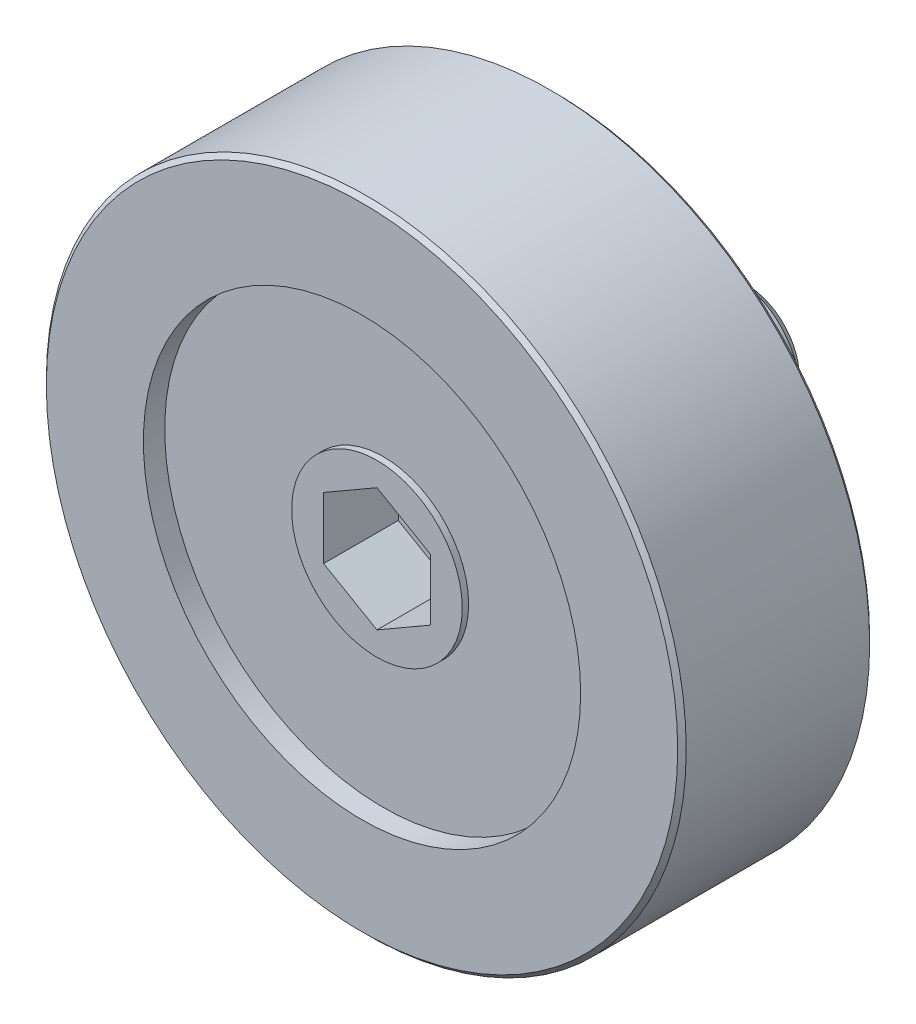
ISO-10303-21;
HEADER;
FILE_DESCRIPTION(('STEP AP214'),'2;1');
FILE_NAME('part.step','',(''),(''),'','','');
FILE_SCHEMA(('AUTOMOTIVE_DESIGN { 1 0 10303 214 1 1 1 1 }'));
ENDSEC;
DATA;
#1=APPLICATION_CONTEXT('core data for automotive mechanical design processes');
#2=APPLICATION_PROTOCOL_DEFINITION('international standard','automotive_design',2000,#1);
#3=PRODUCT_CONTEXT('',#1,'mechanical');
#4=PRODUCT('Part','Part','',(#3));
#5=PRODUCT_RELATED_PRODUCT_CATEGORY('part','',(#4));
#6=PRODUCT_DEFINITION_FORMATION('','',#4);
#7=PRODUCT_DEFINITION_CONTEXT('part definition',#1,'design');
#8=PRODUCT_DEFINITION('design','',#6,#7);
#9=PRODUCT_DEFINITION_SHAPE('','',#8);
#10=(LENGTH_UNIT() NAMED_UNIT(*) SI_UNIT(.MILLI.,.METRE.));
#11=(NAMED_UNIT(*) PLANE_ANGLE_UNIT() SI_UNIT($,.RADIAN.));
#12=(NAMED_UNIT(*) SI_UNIT($,.STERADIAN.) SOLID_ANGLE_UNIT());
#13=UNCERTAINTY_MEASURE_WITH_UNIT(LENGTH_MEASURE(1.E-05),#10,'distance_accuracy_value','');
#14=(GEOMETRIC_REPRESENTATION_CONTEXT(3) GLOBAL_UNCERTAINTY_ASSIGNED_CONTEXT((#13)) GLOBAL_UNIT_ASSIGNED_CONTEXT((#10,
#11,#12)) REPRESENTATION_CONTEXT('',''));
#15=CARTESIAN_POINT('',(0.,0.,0.));
#16=DIRECTION('',(0.,0.,1.));
#17=DIRECTION('',(1.,0.,0.));
#18=AXIS2_PLACEMENT_3D('',#15,#16,#17);
#19=CARTESIAN_POINT('',(0.,14.8,10.));
#20=DIRECTION('',(0.,0.,1.));
#21=DIRECTION('',(1.,0.,0.));
#22=AXIS2_PLACEMENT_3D('',#19,#20,#21);
#23=PLANE('',#22);
#24=CARTESIAN_POINT('',(0.,0.,9.99999999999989));
#25=DIRECTION('',(0.,0.,1.));
#26=DIRECTION('',(1.,0.,0.));
#27=AXIS2_PLACEMENT_3D('',#24,#25,#26);
#28=CIRCLE('',#27,14.8);
#29=CARTESIAN_POINT('',(14.8,0.,9.99999999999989));
#30=VERTEX_POINT('',#29);
#31=EDGE_CURVE('E9',#30,#30,#28,.T.);
#32=ORIENTED_EDGE('',*,*,#31,.T.);
#33=EDGE_LOOP('',(#32));
#34=FACE_BOUND('',#33,.T.);
#35=CARTESIAN_POINT('',(0.,0.,10.));
#36=DIRECTION('',(0.,0.,1.));
#37=DIRECTION('',(1.,0.,0.));
#38=AXIS2_PLACEMENT_3D('',#35,#36,#37);
#39=CIRCLE('',#38,10.25);
#40=CARTESIAN_POINT('',(10.25,0.,10.));
#41=VERTEX_POINT('',#40);
#42=EDGE_CURVE('E115',#41,#41,#39,.T.);
#43=ORIENTED_EDGE('',*,*,#42,.F.);
#44=EDGE_LOOP('',(#43));
#45=FACE_BOUND('',#44,.T.);
#46=ADVANCED_FACE('F14',(#34,#45),#23,.T.);
#47=CARTESIAN_POINT('',(0.,0.,9.99999999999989));
#48=DIRECTION('',(0.,0.,-1.));
#49=DIRECTION('',(-1.,0.,0.));
#50=AXIS2_PLACEMENT_3D('',#47,#48,#49);
#51=CONICAL_SURFACE('',#50,14.8,0.785398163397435);
#52=CARTESIAN_POINT('',(0.,0.,9.79999999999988));
#53=DIRECTION('',(0.,0.,1.));
#54=DIRECTION('',(1.,0.,0.));
#55=AXIS2_PLACEMENT_3D('',#52,#53,#54);
#56=CIRCLE('',#55,15.);
#57=CARTESIAN_POINT('',(15.,0.,9.79999999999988));
#58=VERTEX_POINT('',#57);
#59=EDGE_CURVE('E21',#58,#58,#56,.T.);
#60=ORIENTED_EDGE('',*,*,#59,.T.);
#61=EDGE_LOOP('',(#60));
#62=FACE_BOUND('',#61,.T.);
#63=ORIENTED_EDGE('',*,*,#31,.F.);
#64=EDGE_LOOP('',(#63));
#65=FACE_BOUND('',#64,.T.);
#66=ADVANCED_FACE('F167',(#62,#65),#51,.T.);
#67=CARTESIAN_POINT('',(0.,0.,13.));
#68=DIRECTION('',(0.,0.,1.));
#69=DIRECTION('',(1.,0.,0.));
#70=AXIS2_PLACEMENT_3D('',#67,#68,#69);
#71=CYLINDRICAL_SURFACE('',#70,15.);
#72=CARTESIAN_POINT('',(0.,0.,1.2));
#73=DIRECTION('',(0.,0.,1.));
#74=DIRECTION('',(1.,0.,0.));
#75=AXIS2_PLACEMENT_3D('',#72,#73,#74);
#76=CIRCLE('',#75,15.);
#77=CARTESIAN_POINT('',(15.,0.,1.2));
#78=VERTEX_POINT('',#77);
#79=EDGE_CURVE('E162',#78,#78,#76,.T.);
#80=ORIENTED_EDGE('',*,*,#79,.T.);
#81=EDGE_LOOP('',(#80));
#82=FACE_BOUND('',#81,.T.);
#83=ORIENTED_EDGE('',*,*,#59,.F.);
#84=EDGE_LOOP('',(#83));
#85=FACE_BOUND('',#84,.T.);
#86=ADVANCED_FACE('F170',(#82,#85),#71,.T.);
#87=CARTESIAN_POINT('',(0.,0.,1.2));
#88=DIRECTION('',(0.,0.,1.));
#89=DIRECTION('',(1.,0.,0.));
#90=AXIS2_PLACEMENT_3D('',#87,#88,#89);
#91=CONICAL_SURFACE('',#90,15.,0.785398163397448);
#92=CARTESIAN_POINT('',(0.,0.,1.));
#93=DIRECTION('',(0.,0.,1.));
#94=DIRECTION('',(1.,0.,0.));
#95=AXIS2_PLACEMENT_3D('',#92,#93,#94);
#96=CIRCLE('',#95,14.8);
#97=CARTESIAN_POINT('',(14.8,0.,1.));
#98=VERTEX_POINT('',#97);
#99=EDGE_CURVE('E159',#98,#98,#96,.T.);
#100=ORIENTED_EDGE('',*,*,#99,.T.);
#101=EDGE_LOOP('',(#100));
#102=FACE_BOUND('',#101,.T.);
#103=ORIENTED_EDGE('',*,*,#79,.F.);
#104=EDGE_LOOP('',(#103));
#105=FACE_BOUND('',#104,.T.);
#106=ADVANCED_FACE('F172',(#102,#105),#91,.T.);
#107=CARTESIAN_POINT('',(0.,14.8,1.));
#108=DIRECTION('',(0.,0.,-1.));
#109=DIRECTION('',(-1.,0.,0.));
#110=AXIS2_PLACEMENT_3D('',#107,#108,#109);
#111=PLANE('',#110);
#112=CARTESIAN_POINT('',(0.,0.,1.));
#113=DIRECTION('',(0.,0.,1.));
#114=DIRECTION('',(1.,0.,0.));
#115=AXIS2_PLACEMENT_3D('',#112,#113,#114);
#116=CIRCLE('',#115,10.25);
#117=CARTESIAN_POINT('',(10.25,0.,1.));
#118=VERTEX_POINT('',#117);
#119=EDGE_CURVE('E156',#118,#118,#116,.T.);
#120=ORIENTED_EDGE('',*,*,#119,.T.);
#121=EDGE_LOOP('',(#120));
#122=FACE_BOUND('',#121,.T.);
#123=ORIENTED_EDGE('',*,*,#99,.F.);
#124=EDGE_LOOP('',(#123));
#125=FACE_BOUND('',#124,.T.);
#126=ADVANCED_FACE('F181',(#122,#125),#111,.T.);
#127=CARTESIAN_POINT('',(0.,0.,13.));
#128=DIRECTION('',(0.,0.,1.));
#129=DIRECTION('',(1.,0.,0.));
#130=AXIS2_PLACEMENT_3D('',#127,#128,#129);
#131=CYLINDRICAL_SURFACE('',#130,10.25);
#132=CARTESIAN_POINT('',(0.,0.,2.));
#133=DIRECTION('',(0.,0.,1.));
#134=DIRECTION('',(1.,0.,0.));
#135=AXIS2_PLACEMENT_3D('',#132,#133,#134);
#136=CIRCLE('',#135,10.25);
#137=CARTESIAN_POINT('',(10.25,0.,2.));
#138=VERTEX_POINT('',#137);
#139=EDGE_CURVE('E153',#138,#138,#136,.T.);
#140=ORIENTED_EDGE('',*,*,#139,.T.);
#141=EDGE_LOOP('',(#140));
#142=FACE_BOUND('',#141,.T.);
#143=ORIENTED_EDGE('',*,*,#119,.F.);
#144=EDGE_LOOP('',(#143));
#145=FACE_BOUND('',#144,.T.);
#146=ADVANCED_FACE('F251',(#142,#145),#131,.F.);
#147=CARTESIAN_POINT('',(0.,5.1,2.));
#148=DIRECTION('',(0.,0.,-1.));
#149=DIRECTION('',(-1.,0.,0.));
#150=AXIS2_PLACEMENT_3D('',#147,#148,#149);
#151=PLANE('',#150);
#152=CARTESIAN_POINT('',(0.,0.,2.));
#153=DIRECTION('',(0.,0.,1.));
#154=DIRECTION('',(1.,0.,0.));
#155=AXIS2_PLACEMENT_3D('',#152,#153,#154);
#156=CIRCLE('',#155,5.1);
#157=CARTESIAN_POINT('',(5.1,0.,2.));
#158=VERTEX_POINT('',#157);
#159=EDGE_CURVE('E150',#158,#158,#156,.T.);
#160=ORIENTED_EDGE('',*,*,#159,.T.);
#161=EDGE_LOOP('',(#160));
#162=FACE_BOUND('',#161,.T.);
#163=ORIENTED_EDGE('',*,*,#139,.F.);
#164=EDGE_LOOP('',(#163));
#165=FACE_BOUND('',#164,.T.);
#166=ADVANCED_FACE('F247',(#162,#165),#151,.T.);
#167=CARTESIAN_POINT('',(0.,0.,13.));
#168=DIRECTION('',(0.,0.,1.));
#169=DIRECTION('',(1.,0.,0.));
#170=AXIS2_PLACEMENT_3D('',#167,#168,#169);
#171=CYLINDRICAL_SURFACE('',#170,5.1);
#172=CARTESIAN_POINT('',(0.,0.,0.));
#173=DIRECTION('',(0.,0.,1.));
#174=DIRECTION('',(1.,0.,0.));
#175=AXIS2_PLACEMENT_3D('',#172,#173,#174);
#176=CIRCLE('',#175,5.1);
#177=CARTESIAN_POINT('',(5.1,0.,0.));
#178=VERTEX_POINT('',#177);
#179=EDGE_CURVE('E147',#178,#178,#176,.T.);
#180=ORIENTED_EDGE('',*,*,#179,.T.);
#181=EDGE_LOOP('',(#180));
#182=FACE_BOUND('',#181,.T.);
#183=ORIENTED_EDGE('',*,*,#159,.F.);
#184=EDGE_LOOP('',(#183));
#185=FACE_BOUND('',#184,.T.);
#186=ADVANCED_FACE('F243',(#182,#185),#171,.T.);
#187=CARTESIAN_POINT('',(0.,5.1,0.));
#188=DIRECTION('',(0.,0.,-1.));
#189=DIRECTION('',(-1.,0.,0.));
#190=AXIS2_PLACEMENT_3D('',#187,#188,#189);
#191=PLANE('',#190);
#192=CARTESIAN_POINT('',(0.,0.,0.));
#193=DIRECTION('',(0.,0.,1.));
#194=DIRECTION('',(1.,0.,0.));
#195=AXIS2_PLACEMENT_3D('',#192,#193,#194);
#196=CIRCLE('',#195,2.35);
#197=CARTESIAN_POINT('',(2.35,0.,0.));
#198=VERTEX_POINT('',#197);
#199=EDGE_CURVE('E144',#198,#198,#196,.T.);
#200=ORIENTED_EDGE('',*,*,#199,.T.);
#201=EDGE_LOOP('',(#200));
#202=FACE_BOUND('',#201,.T.);
#203=ORIENTED_EDGE('',*,*,#179,.F.);
#204=EDGE_LOOP('',(#203));
#205=FACE_BOUND('',#204,.T.);
#206=ADVANCED_FACE('F239',(#202,#205),#191,.T.);
#207=CARTESIAN_POINT('',(0.,0.,13.));
#208=DIRECTION('',(0.,0.,1.));
#209=DIRECTION('',(1.,0.,0.));
#210=AXIS2_PLACEMENT_3D('',#207,#208,#209);
#211=CYLINDRICAL_SURFACE('',#210,2.35);
#212=CARTESIAN_POINT('',(0.,0.,-2.));
#213=DIRECTION('',(0.,0.,1.));
#214=DIRECTION('',(1.,0.,0.));
#215=AXIS2_PLACEMENT_3D('',#212,#213,#214);
#216=CIRCLE('',#215,2.35);
#217=CARTESIAN_POINT('',(2.35,0.,-2.));
#218=VERTEX_POINT('',#217);
#219=EDGE_CURVE('E141',#218,#218,#216,.T.);
#220=ORIENTED_EDGE('',*,*,#219,.T.);
#221=EDGE_LOOP('',(#220));
#222=FACE_BOUND('',#221,.T.);
#223=ORIENTED_EDGE('',*,*,#199,.F.);
#224=EDGE_LOOP('',(#223));
#225=FACE_BOUND('',#224,.T.);
#226=ADVANCED_FACE('F235',(#222,#225),#211,.T.);
#227=CARTESIAN_POINT('',(0.,2.35,-2.));
#228=DIRECTION('',(0.,0.,1.));
#229=DIRECTION('',(1.,0.,0.));
#230=AXIS2_PLACEMENT_3D('',#227,#228,#229);
#231=PLANE('',#230);
#232=CARTESIAN_POINT('',(0.,0.,-2.));
#233=DIRECTION('',(0.,0.,1.));
#234=DIRECTION('',(1.,0.,0.));
#235=AXIS2_PLACEMENT_3D('',#232,#233,#234);
#236=CIRCLE('',#235,3.);
#237=CARTESIAN_POINT('',(3.,0.,-2.));
#238=VERTEX_POINT('',#237);
#239=EDGE_CURVE('E138',#238,#238,#236,.T.);
#240=ORIENTED_EDGE('',*,*,#239,.T.);
#241=EDGE_LOOP('',(#240));
#242=FACE_BOUND('',#241,.T.);
#243=ORIENTED_EDGE('',*,*,#219,.F.);
#244=EDGE_LOOP('',(#243));
#245=FACE_BOUND('',#244,.T.);
#246=ADVANCED_FACE('F231',(#242,#245),#231,.T.);
#247=CARTESIAN_POINT('',(0.,0.,13.));
#248=DIRECTION('',(0.,0.,1.));
#249=DIRECTION('',(1.,0.,0.));
#250=AXIS2_PLACEMENT_3D('',#247,#248,#249);
#251=CYLINDRICAL_SURFACE('',#250,3.);
#252=CARTESIAN_POINT('',(0.,0.,-7.5));
#253=DIRECTION('',(0.,0.,1.));
#254=DIRECTION('',(1.,0.,0.));
#255=AXIS2_PLACEMENT_3D('',#252,#253,#254);
#256=CIRCLE('',#255,3.);
#257=CARTESIAN_POINT('',(3.,0.,-7.5));
#258=VERTEX_POINT('',#257);
#259=EDGE_CURVE('E135',#258,#258,#256,.T.);
#260=ORIENTED_EDGE('',*,*,#259,.T.);
#261=EDGE_LOOP('',(#260));
#262=FACE_BOUND('',#261,.T.);
#263=ORIENTED_EDGE('',*,*,#239,.F.);
#264=EDGE_LOOP('',(#263));
#265=FACE_BOUND('',#264,.T.);
#266=ADVANCED_FACE('F227',(#262,#265),#251,.T.);
#267=CARTESIAN_POINT('',(0.,0.,-7.5));
#268=DIRECTION('',(0.,0.,1.));
#269=DIRECTION('',(1.,0.,0.));
#270=AXIS2_PLACEMENT_3D('',#267,#268,#269);
#271=CONICAL_SURFACE('',#270,3.,0.785398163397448);
#272=CARTESIAN_POINT('',(0.,0.,-8.));
#273=DIRECTION('',(0.,0.,1.));
#274=DIRECTION('',(1.,0.,0.));
#275=AXIS2_PLACEMENT_3D('',#272,#273,#274);
#276=CIRCLE('',#275,2.5);
#277=CARTESIAN_POINT('',(2.5,0.,-8.));
#278=VERTEX_POINT('',#277);
#279=EDGE_CURVE('E132',#278,#278,#276,.T.);
#280=ORIENTED_EDGE('',*,*,#279,.T.);
#281=EDGE_LOOP('',(#280));
#282=FACE_BOUND('',#281,.T.);
#283=ORIENTED_EDGE('',*,*,#259,.F.);
#284=EDGE_LOOP('',(#283));
#285=FACE_BOUND('',#284,.T.);
#286=ADVANCED_FACE('F221',(#282,#285),#271,.T.);
#287=CARTESIAN_POINT('',(0.,0.,-8.));
#288=DIRECTION('',(0.,0.,-1.));
#289=DIRECTION('',(-1.,0.,0.));
#290=AXIS2_PLACEMENT_3D('',#287,#288,#289);
#291=PLANE('',#290);
#292=ORIENTED_EDGE('',*,*,#279,.F.);
#293=EDGE_LOOP('',(#292));
#294=FACE_BOUND('',#293,.T.);
#295=ADVANCED_FACE('F214',(#294),#291,.T.);
#296=CARTESIAN_POINT('',(0.,4.00000000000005,9.3));
#297=DIRECTION('',(0.,0.,1.));
#298=DIRECTION('',(1.,0.,0.));
#299=AXIS2_PLACEMENT_3D('',#296,#297,#298);
#300=PLANE('',#299);
#301=DIRECTION('',(-0.866025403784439,0.5,0.));
#302=VECTOR('',#301,1.);
#303=CARTESIAN_POINT('',(2.5,1.44337567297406,9.3));
#304=LINE('',#303,#302);
#305=CARTESIAN_POINT('',(2.5,1.44337567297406,9.3));
#306=VERTEX_POINT('',#305);
#307=CARTESIAN_POINT('',(0.,2.88675134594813,9.3));
#308=VERTEX_POINT('',#307);
#309=EDGE_CURVE('E28',#306,#308,#304,.T.);
#310=ORIENTED_EDGE('',*,*,#309,.F.);
#311=DIRECTION('',(0.,1.,0.));
#312=VECTOR('',#311,1.);
#313=CARTESIAN_POINT('',(2.5,-1.44337567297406,9.3));
#314=LINE('',#313,#312);
#315=CARTESIAN_POINT('',(2.5,-1.44337567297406,9.3));
#316=VERTEX_POINT('',#315);
#317=EDGE_CURVE('E111',#316,#306,#314,.T.);
#318=ORIENTED_EDGE('',*,*,#317,.F.);
#319=DIRECTION('',(0.866025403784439,0.5,0.));
#320=VECTOR('',#319,1.);
#321=CARTESIAN_POINT('',(0.,-2.88675134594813,9.3));
#322=LINE('',#321,#320);
#323=CARTESIAN_POINT('',(0.,-2.88675134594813,9.3));
#324=VERTEX_POINT('',#323);
#325=EDGE_CURVE('E109',#324,#316,#322,.T.);
#326=ORIENTED_EDGE('',*,*,#325,.F.);
#327=DIRECTION('',(0.866025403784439,-0.5,0.));
#328=VECTOR('',#327,1.);
#329=CARTESIAN_POINT('',(-2.5,-1.44337567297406,9.3));
#330=LINE('',#329,#328);
#331=CARTESIAN_POINT('',(-2.5,-1.44337567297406,9.3));
#332=VERTEX_POINT('',#331);
#333=EDGE_CURVE('E76',#332,#324,#330,.T.);
#334=ORIENTED_EDGE('',*,*,#333,.F.);
#335=DIRECTION('',(0.,-1.,0.));
#336=VECTOR('',#335,1.);
#337=CARTESIAN_POINT('',(-2.5,1.44337567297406,9.3));
#338=LINE('',#337,#336);
#339=CARTESIAN_POINT('',(-2.5,1.44337567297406,9.3));
#340=VERTEX_POINT('',#339);
#341=EDGE_CURVE('E105',#340,#332,#338,.T.);
#342=ORIENTED_EDGE('',*,*,#341,.F.);
#343=DIRECTION('',(-0.866025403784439,-0.5,0.));
#344=VECTOR('',#343,1.);
#345=CARTESIAN_POINT('',(0.,2.88675134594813,9.3));
#346=LINE('',#345,#344);
#347=EDGE_CURVE('E102',#308,#340,#346,.T.);
#348=ORIENTED_EDGE('',*,*,#347,.F.);
#349=EDGE_LOOP('',(#310,#318,#326,#334,#342,#348));
#350=FACE_BOUND('',#349,.T.);
#351=CARTESIAN_POINT('',(0.,0.,9.3));
#352=DIRECTION('',(0.,0.,1.));
#353=DIRECTION('',(1.,0.,0.));
#354=AXIS2_PLACEMENT_3D('',#351,#352,#353);
#355=CIRCLE('',#354,4.00000000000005);
#356=CARTESIAN_POINT('',(4.00000000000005,0.,9.3));
#357=VERTEX_POINT('',#356);
#358=EDGE_CURVE('E129',#357,#357,#355,.T.);
#359=ORIENTED_EDGE('',*,*,#358,.T.);
#360=EDGE_LOOP('',(#359));
#361=FACE_BOUND('',#360,.T.);
#362=ADVANCED_FACE('F209',(#350,#361),#300,.T.);
#363=CARTESIAN_POINT('',(0.,0.,13.));
#364=DIRECTION('',(0.,0.,1.));
#365=DIRECTION('',(1.,0.,0.));
#366=AXIS2_PLACEMENT_3D('',#363,#364,#365);
#367=CYLINDRICAL_SURFACE('',#366,4.00000000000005);
#368=CARTESIAN_POINT('',(0.,0.,9.));
#369=DIRECTION('',(0.,0.,1.));
#370=DIRECTION('',(1.,0.,0.));
#371=AXIS2_PLACEMENT_3D('',#368,#369,#370);
#372=CIRCLE('',#371,4.00000000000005);
#373=CARTESIAN_POINT('',(4.00000000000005,0.,9.));
#374=VERTEX_POINT('',#373);
#375=EDGE_CURVE('E126',#374,#374,#372,.T.);
#376=ORIENTED_EDGE('',*,*,#375,.T.);
#377=EDGE_LOOP('',(#376));
#378=FACE_BOUND('',#377,.T.);
#379=ORIENTED_EDGE('',*,*,#358,.F.);
#380=EDGE_LOOP('',(#379));
#381=FACE_BOUND('',#380,.T.);
#382=ADVANCED_FACE('F203',(#378,#381),#367,.T.);
#383=CARTESIAN_POINT('',(0.,10.25,9.));
#384=DIRECTION('',(0.,0.,1.));
#385=DIRECTION('',(1.,0.,0.));
#386=AXIS2_PLACEMENT_3D('',#383,#384,#385);
#387=PLANE('',#386);
#388=CARTESIAN_POINT('',(0.,0.,9.));
#389=DIRECTION('',(0.,0.,1.));
#390=DIRECTION('',(1.,0.,0.));
#391=AXIS2_PLACEMENT_3D('',#388,#389,#390);
#392=CIRCLE('',#391,10.25);
#393=CARTESIAN_POINT('',(10.25,0.,9.));
#394=VERTEX_POINT('',#393);
#395=EDGE_CURVE('E123',#394,#394,#392,.T.);
#396=ORIENTED_EDGE('',*,*,#395,.T.);
#397=EDGE_LOOP('',(#396));
#398=FACE_BOUND('',#397,.T.);
#399=ORIENTED_EDGE('',*,*,#375,.F.);
#400=EDGE_LOOP('',(#399));
#401=FACE_BOUND('',#400,.T.);
#402=ADVANCED_FACE('F197',(#398,#401),#387,.T.);
#403=CARTESIAN_POINT('',(0.,0.,13.));
#404=DIRECTION('',(0.,0.,1.));
#405=DIRECTION('',(1.,0.,0.));
#406=AXIS2_PLACEMENT_3D('',#403,#404,#405);
#407=CYLINDRICAL_SURFACE('',#406,10.25);
#408=ORIENTED_EDGE('',*,*,#42,.T.);
#409=EDGE_LOOP('',(#408));
#410=FACE_BOUND('',#409,.T.);
#411=ORIENTED_EDGE('',*,*,#395,.F.);
#412=EDGE_LOOP('',(#411));
#413=FACE_BOUND('',#412,.T.);
#414=ADVANCED_FACE('F193',(#410,#413),#407,.F.);
#415=CARTESIAN_POINT('',(2.5,1.44337567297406,5.8));
#416=DIRECTION('',(0.5,0.866025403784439,0.));
#417=DIRECTION('',(-0.866025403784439,0.5,0.));
#418=AXIS2_PLACEMENT_3D('',#415,#416,#417);
#419=PLANE('',#418);
#420=ORIENTED_EDGE('',*,*,#309,.T.);
#421=DIRECTION('',(0.,0.,1.));
#422=VECTOR('',#421,1.);
#423=CARTESIAN_POINT('',(0.,2.88675134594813,5.8));
#424=LINE('',#423,#422);
#425=CARTESIAN_POINT('',(0.,2.88675134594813,5.8));
#426=VERTEX_POINT('',#425);
#427=EDGE_CURVE('E58',#426,#308,#424,.T.);
#428=ORIENTED_EDGE('',*,*,#427,.F.);
#429=DIRECTION('',(-0.866025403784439,0.5,0.));
#430=VECTOR('',#429,1.);
#431=CARTESIAN_POINT('',(2.5,1.44337567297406,5.8));
#432=LINE('',#431,#430);
#433=CARTESIAN_POINT('',(2.5,1.44337567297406,5.8));
#434=VERTEX_POINT('',#433);
#435=EDGE_CURVE('E113',#434,#426,#432,.T.);
#436=ORIENTED_EDGE('',*,*,#435,.F.);
#437=DIRECTION('',(0.,0.,1.));
#438=VECTOR('',#437,1.);
#439=CARTESIAN_POINT('',(2.5,1.44337567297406,5.8));
#440=LINE('',#439,#438);
#441=EDGE_CURVE('E36',#434,#306,#440,.T.);
#442=ORIENTED_EDGE('',*,*,#441,.T.);
#443=EDGE_LOOP('',(#420,#428,#436,#442));
#444=FACE_BOUND('',#443,.T.);
#445=ADVANCED_FACE('F196',(#444),#419,.F.);
#446=CARTESIAN_POINT('',(2.5,-1.44337567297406,5.8));
#447=DIRECTION('',(1.,0.,0.));
#448=DIRECTION('',(0.,0.,-1.));
#449=AXIS2_PLACEMENT_3D('',#446,#447,#448);
#450=PLANE('',#449);
#451=ORIENTED_EDGE('',*,*,#317,.T.);
#452=ORIENTED_EDGE('',*,*,#441,.F.);
#453=DIRECTION('',(0.,1.,0.));
#454=VECTOR('',#453,1.);
#455=CARTESIAN_POINT('',(2.5,-1.44337567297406,5.8));
#456=LINE('',#455,#454);
#457=CARTESIAN_POINT('',(2.5,-1.44337567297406,5.8));
#458=VERTEX_POINT('',#457);
#459=EDGE_CURVE('E88',#458,#434,#456,.T.);
#460=ORIENTED_EDGE('',*,*,#459,.F.);
#461=DIRECTION('',(0.,0.,1.));
#462=VECTOR('',#461,1.);
#463=CARTESIAN_POINT('',(2.5,-1.44337567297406,5.8));
#464=LINE('',#463,#462);
#465=EDGE_CURVE('E80',#458,#316,#464,.T.);
#466=ORIENTED_EDGE('',*,*,#465,.T.);
#467=EDGE_LOOP('',(#451,#452,#460,#466));
#468=FACE_BOUND('',#467,.T.);
#469=ADVANCED_FACE('F376',(#468),#450,.F.);
#470=CARTESIAN_POINT('',(0.,-2.88675134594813,5.8));
#471=DIRECTION('',(0.5,-0.866025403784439,0.));
#472=DIRECTION('',(0.866025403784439,0.5,0.));
#473=AXIS2_PLACEMENT_3D('',#470,#471,#472);
#474=PLANE('',#473);
#475=ORIENTED_EDGE('',*,*,#325,.T.);
#476=ORIENTED_EDGE('',*,*,#465,.F.);
#477=DIRECTION('',(0.866025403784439,0.5,0.));
#478=VECTOR('',#477,1.);
#479=CARTESIAN_POINT('',(0.,-2.88675134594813,5.8));
#480=LINE('',#479,#478);
#481=CARTESIAN_POINT('',(0.,-2.88675134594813,5.8));
#482=VERTEX_POINT('',#481);
#483=EDGE_CURVE('E84',#482,#458,#480,.T.);
#484=ORIENTED_EDGE('',*,*,#483,.F.);
#485=DIRECTION('',(0.,0.,1.));
#486=VECTOR('',#485,1.);
#487=CARTESIAN_POINT('',(0.,-2.88675134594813,5.8));
#488=LINE('',#487,#486);
#489=EDGE_CURVE('E69',#482,#324,#488,.T.);
#490=ORIENTED_EDGE('',*,*,#489,.T.);
#491=EDGE_LOOP('',(#475,#476,#484,#490));
#492=FACE_BOUND('',#491,.T.);
#493=ADVANCED_FACE('F85',(#492),#474,.F.);
#494=CARTESIAN_POINT('',(-2.5,-1.44337567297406,5.8));
#495=DIRECTION('',(-0.5,-0.866025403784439,0.));
#496=DIRECTION('',(0.866025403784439,-0.5,0.));
#497=AXIS2_PLACEMENT_3D('',#494,#495,#496);
#498=PLANE('',#497);
#499=ORIENTED_EDGE('',*,*,#333,.T.);
#500=ORIENTED_EDGE('',*,*,#489,.F.);
#501=DIRECTION('',(0.866025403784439,-0.5,0.));
#502=VECTOR('',#501,1.);
#503=CARTESIAN_POINT('',(-2.5,-1.44337567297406,5.8));
#504=LINE('',#503,#502);
#505=CARTESIAN_POINT('',(-2.5,-1.44337567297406,5.8));
#506=VERTEX_POINT('',#505);
#507=EDGE_CURVE('E73',#506,#482,#504,.T.);
#508=ORIENTED_EDGE('',*,*,#507,.F.);
#509=DIRECTION('',(0.,0.,1.));
#510=VECTOR('',#509,1.);
#511=CARTESIAN_POINT('',(-2.5,-1.44337567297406,5.8));
#512=LINE('',#511,#510);
#513=EDGE_CURVE('E81',#506,#332,#512,.T.);
#514=ORIENTED_EDGE('',*,*,#513,.T.);
#515=EDGE_LOOP('',(#499,#500,#508,#514));
#516=FACE_BOUND('',#515,.T.);
#517=ADVANCED_FACE('F71',(#516),#498,.F.);
#518=CARTESIAN_POINT('',(-2.5,1.44337567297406,5.8));
#519=DIRECTION('',(-1.,0.,0.));
#520=DIRECTION('',(0.,-1.,0.));
#521=AXIS2_PLACEMENT_3D('',#518,#519,#520);
#522=PLANE('',#521);
#523=ORIENTED_EDGE('',*,*,#341,.T.);
#524=ORIENTED_EDGE('',*,*,#513,.F.);
#525=DIRECTION('',(0.,-1.,0.));
#526=VECTOR('',#525,1.);
#527=CARTESIAN_POINT('',(-2.5,1.44337567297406,5.8));
#528=LINE('',#527,#526);
#529=CARTESIAN_POINT('',(-2.5,1.44337567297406,5.8));
#530=VERTEX_POINT('',#529);
#531=EDGE_CURVE('E94',#530,#506,#528,.T.);
#532=ORIENTED_EDGE('',*,*,#531,.F.);
#533=DIRECTION('',(0.,0.,1.));
#534=VECTOR('',#533,1.);
#535=CARTESIAN_POINT('',(-2.5,1.44337567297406,5.8));
#536=LINE('',#535,#534);
#537=EDGE_CURVE('E118',#530,#340,#536,.T.);
#538=ORIENTED_EDGE('',*,*,#537,.T.);
#539=EDGE_LOOP('',(#523,#524,#532,#538));
#540=FACE_BOUND('',#539,.T.);
#541=ADVANCED_FACE('F397',(#540),#522,.F.);
#542=CARTESIAN_POINT('',(0.,2.88675134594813,5.8));
#543=DIRECTION('',(-0.5,0.866025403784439,0.));
#544=DIRECTION('',(-0.866025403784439,-0.5,0.));
#545=AXIS2_PLACEMENT_3D('',#542,#543,#544);
#546=PLANE('',#545);
#547=ORIENTED_EDGE('',*,*,#347,.T.);
#548=ORIENTED_EDGE('',*,*,#537,.F.);
#549=DIRECTION('',(-0.866025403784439,-0.5,0.));
#550=VECTOR('',#549,1.);
#551=CARTESIAN_POINT('',(0.,2.88675134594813,5.8));
#552=LINE('',#551,#550);
#553=EDGE_CURVE('E96',#426,#530,#552,.T.);
#554=ORIENTED_EDGE('',*,*,#553,.F.);
#555=ORIENTED_EDGE('',*,*,#427,.T.);
#556=EDGE_LOOP('',(#547,#548,#554,#555));
#557=FACE_BOUND('',#556,.T.);
#558=ADVANCED_FACE('F405',(#557),#546,.F.);
#559=CARTESIAN_POINT('',(0.,0.,5.8));
#560=DIRECTION('',(0.,0.,1.));
#561=DIRECTION('',(1.,0.,0.));
#562=AXIS2_PLACEMENT_3D('',#559,#560,#561);
#563=PLANE('',#562);
#564=ORIENTED_EDGE('',*,*,#435,.T.);
#565=ORIENTED_EDGE('',*,*,#553,.T.);
#566=ORIENTED_EDGE('',*,*,#531,.T.);
#567=ORIENTED_EDGE('',*,*,#507,.T.);
#568=ORIENTED_EDGE('',*,*,#483,.T.);
#569=ORIENTED_EDGE('',*,*,#459,.T.);
#570=EDGE_LOOP('',(#564,#565,#566,#567,#568,#569));
#571=FACE_BOUND('',#570,.T.);
#572=ADVANCED_FACE('F91',(#571),#563,.T.);
#573=CLOSED_SHELL('',(#46,#66,#86,#106,#126,#146,#166,#186,#206,#226,#246,#266,#286,#295,#362,
#382,#402,#414,#445,#469,#493,#517,#541,#558,#572));
#574=MANIFOLD_SOLID_BREP('B1',#573);
#575=ADVANCED_BREP_SHAPE_REPRESENTATION('',(#18,#574),#14);
#576=SHAPE_DEFINITION_REPRESENTATION(#9,#575);
ENDSEC;
END-ISO-10303-21;
